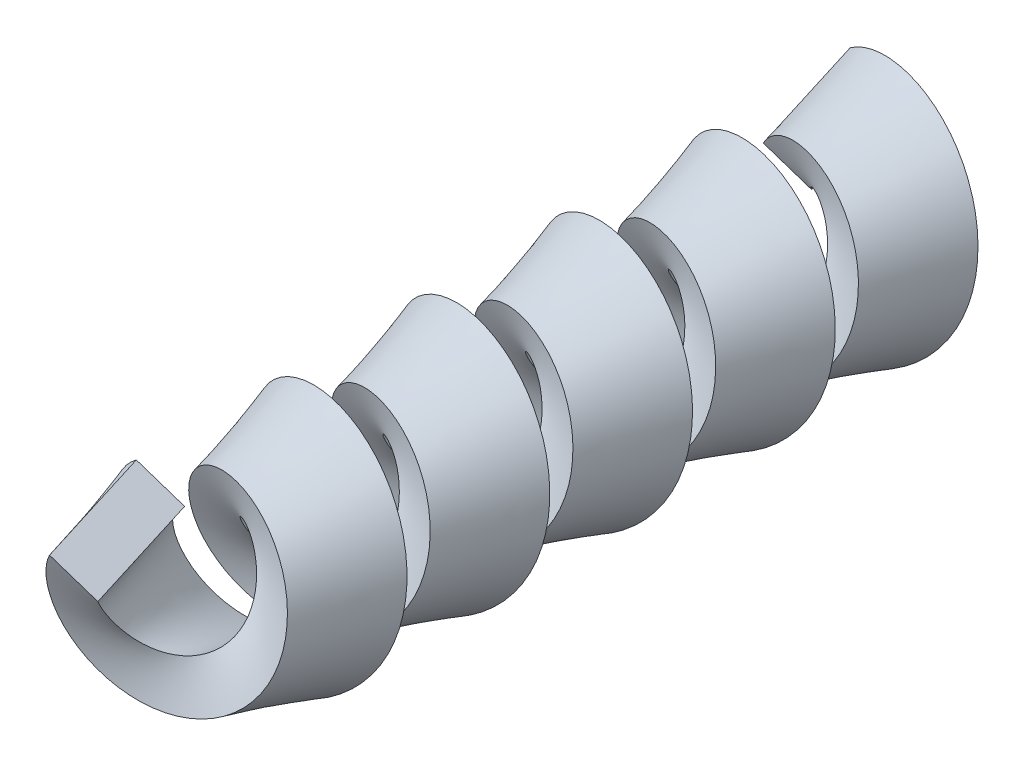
from build123d import *

# Parameters (mm, degrees)
AUSTRAGUNG1_PITCH       = 75
AUSTRAGUNG1_HEIGHT      = 375
AUSTRAGUNG1_RADIUS      = 37.5
AUSTRAGUNG1_START_ANGLE = 135
SKIZZE2_W               = 25
SKIZZE2_H               = 50


with BuildPart() as part:
    # Austragung1: sweep along a helix
    with BuildLine() as austragung1_path:
        add(Helix(AUSTRAGUNG1_PITCH, AUSTRAGUNG1_HEIGHT, AUSTRAGUNG1_RADIUS, center=(0, 0, 0), direction=(0, 0, 1), lefthand=True, mode=Mode.PRIVATE).rotate(Axis((0, 0, 0), (0, 0, 1)), AUSTRAGUNG1_START_ANGLE))
    # Skizze2 → Austragung1 (sweep)
    with BuildSketch(Plane(origin=(-26.516504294, 26.516504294, 0), x_dir=(-0.738918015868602, 0.6144120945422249, 0.2765826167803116), z_dir=(0.6737953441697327, 0.673795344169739, 0.30331447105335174))):
        Rectangle(SKIZZE2_W, SKIZZE2_H)
    sweep(path=austragung1_path.line, is_frenet=True)


solid = part.part
